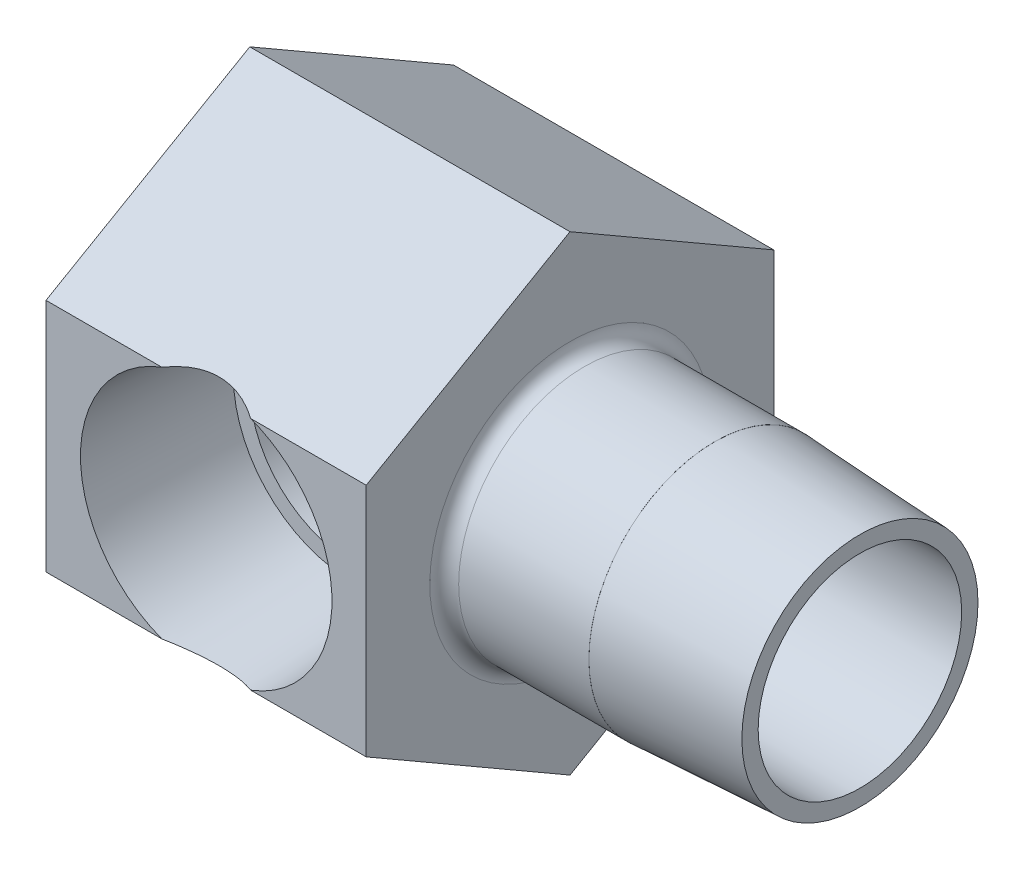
ISO-10303-21;
HEADER;
FILE_DESCRIPTION(('STEP AP214'),'2;1');
FILE_NAME('part.step','',(''),(''),'','','');
FILE_SCHEMA(('AUTOMOTIVE_DESIGN { 1 0 10303 214 1 1 1 1 }'));
ENDSEC;
DATA;
#1=APPLICATION_CONTEXT('core data for automotive mechanical design processes');
#2=APPLICATION_PROTOCOL_DEFINITION('international standard','automotive_design',2000,#1);
#3=PRODUCT_CONTEXT('',#1,'mechanical');
#4=PRODUCT('Part','Part','',(#3));
#5=PRODUCT_RELATED_PRODUCT_CATEGORY('part','',(#4));
#6=PRODUCT_DEFINITION_FORMATION('','',#4);
#7=PRODUCT_DEFINITION_CONTEXT('part definition',#1,'design');
#8=PRODUCT_DEFINITION('design','',#6,#7);
#9=PRODUCT_DEFINITION_SHAPE('','',#8);
#10=(LENGTH_UNIT() NAMED_UNIT(*) SI_UNIT(.MILLI.,.METRE.));
#11=(NAMED_UNIT(*) PLANE_ANGLE_UNIT() SI_UNIT($,.RADIAN.));
#12=(NAMED_UNIT(*) SI_UNIT($,.STERADIAN.) SOLID_ANGLE_UNIT());
#13=UNCERTAINTY_MEASURE_WITH_UNIT(LENGTH_MEASURE(1.E-05),#10,'distance_accuracy_value','');
#14=(GEOMETRIC_REPRESENTATION_CONTEXT(3) GLOBAL_UNCERTAINTY_ASSIGNED_CONTEXT((#13)) GLOBAL_UNIT_ASSIGNED_CONTEXT((#10,
#11,#12)) REPRESENTATION_CONTEXT('',''));
#15=CARTESIAN_POINT('',(0.,0.,0.));
#16=DIRECTION('',(0.,0.,1.));
#17=DIRECTION('',(1.,0.,0.));
#18=AXIS2_PLACEMENT_3D('',#15,#16,#17);
#19=CARTESIAN_POINT('',(7.9248,0.,0.));
#20=DIRECTION('',(-1.,0.,0.));
#21=DIRECTION('',(0.,0.,1.));
#22=AXIS2_PLACEMENT_3D('',#19,#20,#21);
#23=PLANE('',#22);
#24=CARTESIAN_POINT('',(7.9248,0.,0.));
#25=DIRECTION('',(-1.,0.,0.));
#26=DIRECTION('',(0.,0.,1.));
#27=AXIS2_PLACEMENT_3D('',#24,#25,#26);
#28=CIRCLE('',#27,5.5499);
#29=CARTESIAN_POINT('',(7.9248,0.,5.5499));
#30=VERTEX_POINT('',#29);
#31=EDGE_CURVE('E157',#30,#30,#28,.F.);
#32=ORIENTED_EDGE('',*,*,#31,.F.);
#33=EDGE_LOOP('',(#32));
#34=FACE_BOUND('',#33,.T.);
#35=CARTESIAN_POINT('',(7.9248,0.,0.));
#36=DIRECTION('',(-1.,0.,0.));
#37=DIRECTION('',(0.,0.,1.));
#38=AXIS2_PLACEMENT_3D('',#35,#36,#37);
#39=CIRCLE('',#38,6.4389);
#40=CARTESIAN_POINT('',(7.9248,0.,6.4389));
#41=VERTEX_POINT('',#40);
#42=EDGE_CURVE('E161',#41,#41,#39,.T.);
#43=ORIENTED_EDGE('',*,*,#42,.F.);
#44=EDGE_LOOP('',(#43));
#45=FACE_BOUND('',#44,.T.);
#46=ADVANCED_FACE('F14',(#34,#45),#23,.F.);
#47=CARTESIAN_POINT('',(38.1508,0.,0.));
#48=DIRECTION('',(-1.,0.,0.));
#49=DIRECTION('',(0.,0.,1.));
#50=AXIS2_PLACEMENT_3D('',#47,#48,#49);
#51=CYLINDRICAL_SURFACE('',#50,6.858);
#52=CARTESIAN_POINT('',(-7.0993,0.,0.));
#53=DIRECTION('',(-1.,0.,0.));
#54=DIRECTION('',(0.,-1.,0.));
#55=AXIS2_PLACEMENT_3D('',#52,#53,#54);
#56=CIRCLE('',#55,6.858);
#57=CARTESIAN_POINT('',(-7.0993,-6.858,0.));
#58=VERTEX_POINT('',#57);
#59=EDGE_CURVE('E22',#58,#58,#56,.F.);
#60=ORIENTED_EDGE('',*,*,#59,.T.);
#61=EDGE_LOOP('',(#60));
#62=FACE_BOUND('',#61,.T.);
#63=CARTESIAN_POINT('',(0.,0.,0.));
#64=DIRECTION('',(1.,0.,0.));
#65=DIRECTION('',(0.,0.,-1.));
#66=AXIS2_PLACEMENT_3D('',#63,#64,#65);
#67=CIRCLE('',#66,6.858);
#68=CARTESIAN_POINT('',(0.,0.,-6.858));
#69=VERTEX_POINT('',#68);
#70=EDGE_CURVE('E17',#69,#69,#67,.F.);
#71=ORIENTED_EDGE('',*,*,#70,.T.);
#72=EDGE_LOOP('',(#71));
#73=FACE_BOUND('',#72,.T.);
#74=ADVANCED_FACE('F169',(#62,#73),#51,.T.);
#75=CARTESIAN_POINT('',(-16.6116,0.,11.1125));
#76=DIRECTION('',(0.,0.,1.));
#77=DIRECTION('',(1.,0.,0.));
#78=AXIS2_PLACEMENT_3D('',#75,#76,#77);
#79=CONICAL_SURFACE('',#78,6.858,0.0523598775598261);
#80=CARTESIAN_POINT('',(-16.6116,-0.680996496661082,23.4045205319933));
#81=DIRECTION('',(0.,-0.866025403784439,-0.5));
#82=DIRECTION('',(0.,-0.5,0.866025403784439));
#83=AXIS2_PLACEMENT_3D('',#80,#81,#82);
#84=ELLIPSE('',#83,15.0043949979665,7.47122554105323);
#85=CARTESIAN_POINT('',(-14.1888718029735,6.4158048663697,11.1125));
#86=VERTEX_POINT('',#85);
#87=CARTESIAN_POINT('',(-19.0343281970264,6.4158048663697,11.1125));
#88=VERTEX_POINT('',#87);
#89=EDGE_CURVE('E226',#86,#88,#84,.F.);
#90=ORIENTED_EDGE('',*,*,#89,.T.);
#91=CARTESIAN_POINT('',(-16.6116,0.,11.1125));
#92=DIRECTION('',(0.,0.,-1.));
#93=DIRECTION('',(-1.,0.,0.));
#94=AXIS2_PLACEMENT_3D('',#91,#92,#93);
#95=CIRCLE('',#94,6.858);
#96=CARTESIAN_POINT('',(-19.0343281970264,-6.41580486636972,11.1125));
#97=VERTEX_POINT('',#96);
#98=EDGE_CURVE('E37',#97,#88,#95,.T.);
#99=ORIENTED_EDGE('',*,*,#98,.F.);
#100=CARTESIAN_POINT('',(-16.6116,0.680996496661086,23.4045205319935));
#101=DIRECTION('',(0.,0.866025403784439,-0.5));
#102=DIRECTION('',(0.,0.5,0.866025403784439));
#103=AXIS2_PLACEMENT_3D('',#100,#101,#102);
#104=ELLIPSE('',#103,15.0043949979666,7.47122554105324);
#105=CARTESIAN_POINT('',(-14.1888718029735,-6.4158048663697,11.1125));
#106=VERTEX_POINT('',#105);
#107=EDGE_CURVE('E9',#97,#106,#104,.F.);
#108=ORIENTED_EDGE('',*,*,#107,.T.);
#109=EDGE_CURVE('E243',#86,#106,#95,.T.);
#110=ORIENTED_EDGE('',*,*,#109,.F.);
#111=EDGE_LOOP('',(#90,#99,#108,#110));
#112=FACE_BOUND('',#111,.T.);
#113=CARTESIAN_POINT('',(-16.6116,0.,3.1877));
#114=DIRECTION('',(0.,0.,-1.));
#115=DIRECTION('',(-1.,0.,0.));
#116=AXIS2_PLACEMENT_3D('',#113,#114,#115);
#117=CIRCLE('',#116,6.44267883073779);
#118=CARTESIAN_POINT('',(-12.0434327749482,-4.54312213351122,3.1877));
#119=VERTEX_POINT('',#118);
#120=CARTESIAN_POINT('',(-12.0434327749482,4.54312213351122,3.1877));
#121=VERTEX_POINT('',#120);
#122=EDGE_CURVE('E245',#119,#121,#117,.T.);
#123=ORIENTED_EDGE('',*,*,#122,.T.);
#124=CARTESIAN_POINT('',(-12.0435871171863,4.54326245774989,3.1875));
#125=CARTESIAN_POINT('',(-11.9441962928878,4.45290836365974,3.31621906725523));
#126=CARTESIAN_POINT('',(-11.8453747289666,4.35690222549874,3.44148115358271));
#127=CARTESIAN_POINT('',(-11.6502698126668,4.15324987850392,3.68472903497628));
#128=CARTESIAN_POINT('',(-11.5539906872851,4.04558563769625,3.80270310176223));
#129=CARTESIAN_POINT('',(-11.3648299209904,3.81752411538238,4.03164857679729));
#130=CARTESIAN_POINT('',(-11.2719874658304,3.69701926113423,4.14254596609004));
#131=CARTESIAN_POINT('',(-11.0923535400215,3.44414434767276,4.35506206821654));
#132=CARTESIAN_POINT('',(-11.0055581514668,3.31178210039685,4.45668680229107));
#133=CARTESIAN_POINT('',(-10.7964313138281,2.96297657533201,4.69976178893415));
#134=CARTESIAN_POINT('',(-10.6790713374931,2.73858307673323,4.83446514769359));
#135=CARTESIAN_POINT('',(-10.5215825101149,2.38307262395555,5.01397800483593));
#136=CARTESIAN_POINT('',(-10.4722150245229,2.2615363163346,5.07001734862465));
#137=CARTESIAN_POINT('',(-10.3804227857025,2.0125151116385,5.17390985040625));
#138=CARTESIAN_POINT('',(-10.337994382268,1.88503338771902,5.22176731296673));
#139=CARTESIAN_POINT('',(-10.260466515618,1.6232487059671,5.30902180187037));
#140=CARTESIAN_POINT('',(-10.2254580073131,1.48888366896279,5.3483139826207));
#141=CARTESIAN_POINT('',(-10.1642214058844,1.21573970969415,5.41693438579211));
#142=CARTESIAN_POINT('',(-10.1379885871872,1.0769632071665,5.44626797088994));
#143=CARTESIAN_POINT('',(-10.0949533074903,0.796159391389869,5.49434315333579));
#144=CARTESIAN_POINT('',(-10.0781494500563,0.654132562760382,5.51308631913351));
#145=CARTESIAN_POINT('',(-10.0544334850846,0.368243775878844,5.5395290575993));
#146=CARTESIAN_POINT('',(-10.0475196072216,0.22438215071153,5.54723060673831));
#147=CARTESIAN_POINT('',(-10.0440618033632,-0.041379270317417,5.55108277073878));
#148=CARTESIAN_POINT('',(-10.0460821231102,-0.163241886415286,5.54883264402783));
#149=CARTESIAN_POINT('',(-10.0572859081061,-0.406265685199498,5.53634760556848));
#150=CARTESIAN_POINT('',(-10.066471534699,-0.527426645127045,5.52611028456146));
#151=CARTESIAN_POINT('',(-10.0918194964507,-0.768029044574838,5.49783431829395));
#152=CARTESIAN_POINT('',(-10.1079781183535,-0.887471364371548,5.4797998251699));
#153=CARTESIAN_POINT('',(-10.1469528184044,-1.1238947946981,5.43624186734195));
#154=CARTESIAN_POINT('',(-10.1697714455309,-1.24087494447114,5.41071553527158));
#155=CARTESIAN_POINT('',(-10.2461986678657,-1.58064044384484,5.32507161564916));
#156=CARTESIAN_POINT('',(-10.3085401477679,-1.79907617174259,5.25504548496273));
#157=CARTESIAN_POINT('',(-10.4532227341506,-2.2198653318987,5.09162883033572));
#158=CARTESIAN_POINT('',(-10.5355750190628,-2.42220969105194,4.99822524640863));
#159=CARTESIAN_POINT('',(-10.6910379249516,-2.75475802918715,4.82054677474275));
#160=CARTESIAN_POINT('',(-10.760322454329,-2.88934500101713,4.74098873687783));
#161=CARTESIAN_POINT('',(-10.9058041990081,-3.14876465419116,4.57280704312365));
#162=CARTESIAN_POINT('',(-10.9820017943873,-3.27359679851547,4.48418288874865));
#163=CARTESIAN_POINT('',(-11.1400903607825,-3.51355050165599,4.29876602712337));
#164=CARTESIAN_POINT('',(-11.2219905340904,-3.62865566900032,4.20196006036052));
#165=CARTESIAN_POINT('',(-11.3900878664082,-3.84892561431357,4.00116972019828));
#166=CARTESIAN_POINT('',(-11.476283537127,-3.95409379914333,3.89718782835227));
#167=CARTESIAN_POINT('',(-11.6422530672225,-4.14374167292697,3.69431209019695));
#168=CARTESIAN_POINT('',(-11.72170741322,-4.22922772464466,3.59609251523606));
#169=CARTESIAN_POINT('',(-11.8818501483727,-4.39212627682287,3.39517461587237));
#170=CARTESIAN_POINT('',(-11.962530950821,-4.4695749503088,3.29249959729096));
#171=CARTESIAN_POINT('',(-12.0435871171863,-4.54326245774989,3.1875));
#172=B_SPLINE_CURVE_WITH_KNOTS('',3,(#124,#125,#126,#127,#128,#129,#130,#131,#132,#133,#134,
#135,#136,#137,#138,#139,#140,#141,#142,#143,#144,#145,#146,#147,#148,#149,#150,#151,#152,#153,
#154,#155,#156,#157,#158,#159,#160,#161,#162,#163,#164,#165,#166,#167,#168,#169,#170,#171),
.UNSPECIFIED.,.F.,.F.,(4,2,2,2,2,2,2,2,2,2,2,2,2,2,2,2,2,2,2,2,2,2,2,4),(0.,0.558072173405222,
1.11702021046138,1.68108674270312,2.24478434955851,3.10140634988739,3.52893103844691,
3.95623010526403,4.38849766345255,4.82053207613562,5.2525024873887,5.68439556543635,
6.04963287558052,6.41498039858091,6.78013360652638,7.14542675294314,7.85550743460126,
8.5659856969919,9.07835413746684,9.59075076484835,10.1039943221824,10.6170612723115,
11.0743952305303,11.5295724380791),.UNSPECIFIED.);
#173=EDGE_CURVE('E130',#121,#119,#172,.T.);
#174=ORIENTED_EDGE('',*,*,#173,.T.);
#175=EDGE_LOOP('',(#123,#174));
#176=FACE_BOUND('',#175,.T.);
#177=ADVANCED_FACE('F138',(#112,#176),#79,.F.);
#178=CARTESIAN_POINT('',(-10.1689211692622,0.,3.1877));
#179=DIRECTION('',(0.,0.,1.));
#180=DIRECTION('',(1.,0.,0.));
#181=AXIS2_PLACEMENT_3D('',#178,#179,#180);
#182=PLANE('',#181);
#183=ORIENTED_EDGE('',*,*,#122,.F.);
#184=DIRECTION('',(1.,0.,0.));
#185=VECTOR('',#184,1.);
#186=CARTESIAN_POINT('',(40.2763637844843,-4.54312213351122,3.1877));
#187=LINE('',#186,#185);
#188=CARTESIAN_POINT('',(-13.4239,-4.54312213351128,3.1877));
#189=VERTEX_POINT('',#188);
#190=EDGE_CURVE('E128',#119,#189,#187,.F.);
#191=ORIENTED_EDGE('',*,*,#190,.T.);
#192=CARTESIAN_POINT('',(-16.6116,0.,3.1877));
#193=DIRECTION('',(0.,0.,-1.));
#194=DIRECTION('',(-1.,0.,0.));
#195=AXIS2_PLACEMENT_3D('',#192,#193,#194);
#196=CIRCLE('',#195,5.5499);
#197=CARTESIAN_POINT('',(-13.4239,4.54312213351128,3.1877));
#198=VERTEX_POINT('',#197);
#199=EDGE_CURVE('E120',#189,#198,#196,.T.);
#200=ORIENTED_EDGE('',*,*,#199,.T.);
#201=DIRECTION('',(1.,0.,0.));
#202=VECTOR('',#201,1.);
#203=CARTESIAN_POINT('',(40.2763637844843,4.54312213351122,3.1877));
#204=LINE('',#203,#202);
#205=EDGE_CURVE('E123',#198,#121,#204,.T.);
#206=ORIENTED_EDGE('',*,*,#205,.T.);
#207=EDGE_LOOP('',(#183,#191,#200,#206));
#208=FACE_BOUND('',#207,.T.);
#209=ADVANCED_FACE('F260',(#208),#182,.T.);
#210=CARTESIAN_POINT('',(-16.6116,0.,16.5155516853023));
#211=DIRECTION('',(0.,0.,-1.));
#212=DIRECTION('',(-1.,0.,0.));
#213=AXIS2_PLACEMENT_3D('',#210,#211,#212);
#214=CYLINDRICAL_SURFACE('',#213,5.5499);
#215=ORIENTED_EDGE('',*,*,#199,.F.);
#216=CARTESIAN_POINT('',(-16.6116,0.,0.));
#217=DIRECTION('',(0.707106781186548,0.,-0.707106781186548));
#218=DIRECTION('',(-0.707106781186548,0.,-0.707106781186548));
#219=AXIS2_PLACEMENT_3D('',#216,#217,#218);
#220=ELLIPSE('',#219,7.84874384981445,5.5499);
#221=CARTESIAN_POINT('',(-16.6116,-5.5499,0.));
#222=VERTEX_POINT('',#221);
#223=EDGE_CURVE('E109',#189,#222,#220,.T.);
#224=ORIENTED_EDGE('',*,*,#223,.T.);
#225=CARTESIAN_POINT('',(-16.6116,0.,0.));
#226=DIRECTION('',(-0.707106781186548,0.,-0.707106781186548));
#227=DIRECTION('',(0.707106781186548,0.,-0.707106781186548));
#228=AXIS2_PLACEMENT_3D('',#225,#226,#227);
#229=ELLIPSE('',#228,7.84874384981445,5.5499);
#230=CARTESIAN_POINT('',(-11.8783362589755,-2.89786203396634,-4.73326374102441));
#231=VERTEX_POINT('',#230);
#232=EDGE_CURVE('E105',#222,#231,#229,.F.);
#233=ORIENTED_EDGE('',*,*,#232,.T.);
#234=CARTESIAN_POINT('',(-16.6116,0.,-4.73326374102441));
#235=DIRECTION('',(0.,0.,-1.));
#236=DIRECTION('',(-1.,0.,0.));
#237=AXIS2_PLACEMENT_3D('',#234,#235,#236);
#238=CIRCLE('',#237,5.5499);
#239=CARTESIAN_POINT('',(-11.8783362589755,2.89786203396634,-4.73326374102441));
#240=VERTEX_POINT('',#239);
#241=EDGE_CURVE('E136',#231,#240,#238,.T.);
#242=ORIENTED_EDGE('',*,*,#241,.T.);
#243=CARTESIAN_POINT('',(-16.6116,5.5499,0.));
#244=VERTEX_POINT('',#243);
#245=EDGE_CURVE('E30',#240,#244,#229,.F.);
#246=ORIENTED_EDGE('',*,*,#245,.T.);
#247=EDGE_CURVE('E121',#244,#198,#220,.T.);
#248=ORIENTED_EDGE('',*,*,#247,.T.);
#249=EDGE_LOOP('',(#215,#224,#233,#242,#246,#248));
#250=FACE_BOUND('',#249,.T.);
#251=ADVANCED_FACE('F117',(#250),#214,.F.);
#252=CARTESIAN_POINT('',(-16.6116,0.,-4.73326374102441));
#253=DIRECTION('',(0.,0.,1.));
#254=DIRECTION('',(1.,0.,0.));
#255=AXIS2_PLACEMENT_3D('',#252,#253,#254);
#256=CONICAL_SURFACE('',#255,5.5499,1.04719755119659);
#257=CARTESIAN_POINT('',(-16.6116,0.,-7.9375));
#258=VERTEX_POINT('',#257);
#259=VERTEX_LOOP('',#258);
#260=FACE_BOUND('',#259,.T.);
#261=ORIENTED_EDGE('',*,*,#241,.F.);
#262=CARTESIAN_POINT('',(-11.8781300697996,-2.89818868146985,-4.73306374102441));
#263=CARTESIAN_POINT('',(-11.928514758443,-2.81852795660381,-4.78186576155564));
#264=CARTESIAN_POINT('',(-11.9754486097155,-2.73601453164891,-4.8296023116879));
#265=CARTESIAN_POINT('',(-12.0622060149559,-2.56583570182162,-4.92211262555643));
#266=CARTESIAN_POINT('',(-12.1020339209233,-2.47817349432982,-4.96688819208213));
#267=CARTESIAN_POINT('',(-12.1740452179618,-2.29911606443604,-5.05224677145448));
#268=CARTESIAN_POINT('',(-12.2063059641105,-2.20777091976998,-5.09286957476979));
#269=CARTESIAN_POINT('',(-12.2640536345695,-2.02119544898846,-5.16975209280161));
#270=CARTESIAN_POINT('',(-12.2895403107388,-1.92596498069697,-5.20601164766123));
#271=CARTESIAN_POINT('',(-12.3343485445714,-1.73255643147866,-5.27352942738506));
#272=CARTESIAN_POINT('',(-12.3536814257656,-1.63438413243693,-5.30479678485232));
#273=CARTESIAN_POINT('',(-12.3871169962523,-1.4356334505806,-5.36199992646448));
#274=CARTESIAN_POINT('',(-12.4012193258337,-1.33505490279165,-5.38793534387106));
#275=CARTESIAN_POINT('',(-12.4251473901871,-1.13183172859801,-5.43426547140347));
#276=CARTESIAN_POINT('',(-12.4349607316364,-1.02918199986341,-5.45464406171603));
#277=CARTESIAN_POINT('',(-12.4510925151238,-0.822623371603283,-5.48959537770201));
#278=CARTESIAN_POINT('',(-12.457410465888,-0.718714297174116,-5.50416728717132));
#279=CARTESIAN_POINT('',(-12.4681706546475,-0.489671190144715,-5.52968000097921));
#280=CARTESIAN_POINT('',(-12.4720032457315,-0.364365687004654,-5.53935082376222));
#281=CARTESIAN_POINT('',(-12.4762724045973,-0.113319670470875,-5.55016570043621));
#282=CARTESIAN_POINT('',(-12.4767084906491,0.0124209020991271,-5.55130854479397));
#283=CARTESIAN_POINT('',(-12.474260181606,0.263686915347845,-5.545056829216));
#284=CARTESIAN_POINT('',(-12.4713750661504,0.389212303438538,-5.53766041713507));
#285=CARTESIAN_POINT('',(-12.4617808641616,0.639322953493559,-5.51438352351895));
#286=CARTESIAN_POINT('',(-12.4550721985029,0.763908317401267,-5.49850397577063));
#287=CARTESIAN_POINT('',(-12.4375802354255,1.00072761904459,-5.46013354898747));
#288=CARTESIAN_POINT('',(-12.4271972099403,1.11310193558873,-5.4383291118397));
#289=CARTESIAN_POINT('',(-12.4012811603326,1.33574469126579,-5.38796805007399));
#290=CARTESIAN_POINT('',(-12.3857480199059,1.44601308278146,-5.35941127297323));
#291=CARTESIAN_POINT('',(-12.34837201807,1.66326683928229,-5.29600700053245));
#292=CARTESIAN_POINT('',(-12.326549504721,1.77026157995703,-5.26117992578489));
#293=CARTESIAN_POINT('',(-12.2754867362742,1.98033019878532,-5.1857632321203));
#294=CARTESIAN_POINT('',(-12.2462496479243,2.08340572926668,-5.14517607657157));
#295=CARTESIAN_POINT('',(-12.1706029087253,2.31167706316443,-5.04745101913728));
#296=CARTESIAN_POINT('',(-12.1216919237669,2.43541928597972,-4.98878928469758));
#297=CARTESIAN_POINT('',(-12.0380568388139,2.61414296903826,-4.89614210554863));
#298=CARTESIAN_POINT('',(-12.0083727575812,2.67271819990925,-4.86439175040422));
#299=CARTESIAN_POINT('',(-11.9457010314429,2.78735967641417,-4.79961930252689));
#300=CARTESIAN_POINT('',(-11.9127128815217,2.8434255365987,-4.76659701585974));
#301=CARTESIAN_POINT('',(-11.8781300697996,2.89818868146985,-4.73306374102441));
#302=B_SPLINE_CURVE_WITH_KNOTS('',3,(#262,#263,#264,#265,#266,#267,#268,#269,#270,#271,#272,
#273,#274,#275,#276,#277,#278,#279,#280,#281,#282,#283,#284,#285,#286,#287,#288,#289,#290,#291,
#292,#293,#294,#295,#296,#297,#298,#299,#300,#301),.UNSPECIFIED.,.F.,.F.,(4,2,2,2,2,2,2,2,2,2,2,
2,2,2,2,2,2,2,2,4),(0.,0.318348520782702,0.636501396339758,0.951244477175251,1.26599908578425,
1.58017112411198,1.89436476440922,2.20946038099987,2.52460027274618,2.90145665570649,
3.27836648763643,3.65535808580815,4.03230819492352,4.37682355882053,4.72134670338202,
5.06476748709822,5.40804184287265,5.84309066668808,6.06180090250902,6.28054461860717),.UNSPECIFIED.);
#303=EDGE_CURVE('E111',#231,#240,#302,.T.);
#304=ORIENTED_EDGE('',*,*,#303,.T.);
#305=EDGE_LOOP('',(#261,#304));
#306=FACE_BOUND('',#305,.T.);
#307=ADVANCED_FACE('F149',(#260,#306),#256,.F.);
#308=CARTESIAN_POINT('',(-7.8867,12.8316097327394,0.));
#309=DIRECTION('',(0.,-0.866025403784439,-0.5));
#310=DIRECTION('',(0.,0.5,-0.866025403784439));
#311=AXIS2_PLACEMENT_3D('',#308,#309,#310);
#312=PLANE('',#311);
#313=ORIENTED_EDGE('',*,*,#89,.F.);
#314=DIRECTION('',(-1.,0.,0.));
#315=VECTOR('',#314,1.);
#316=CARTESIAN_POINT('',(-7.8867,6.4158048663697,11.1125));
#317=LINE('',#316,#315);
#318=CARTESIAN_POINT('',(-7.8867,6.4158048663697,11.1125));
#319=VERTEX_POINT('',#318);
#320=EDGE_CURVE('E196',#319,#86,#317,.T.);
#321=ORIENTED_EDGE('',*,*,#320,.F.);
#322=DIRECTION('',(0.,-0.5,0.866025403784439));
#323=VECTOR('',#322,1.);
#324=CARTESIAN_POINT('',(-7.8867,12.8316097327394,0.));
#325=LINE('',#324,#323);
#326=CARTESIAN_POINT('',(-7.8867,12.8316097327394,0.));
#327=VERTEX_POINT('',#326);
#328=EDGE_CURVE('E216',#327,#319,#325,.T.);
#329=ORIENTED_EDGE('',*,*,#328,.F.);
#330=DIRECTION('',(-1.,0.,0.));
#331=VECTOR('',#330,1.);
#332=CARTESIAN_POINT('',(-7.8867,12.8316097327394,0.));
#333=LINE('',#332,#331);
#334=CARTESIAN_POINT('',(-25.3492,12.8316097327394,0.));
#335=VERTEX_POINT('',#334);
#336=EDGE_CURVE('E193',#327,#335,#333,.T.);
#337=ORIENTED_EDGE('',*,*,#336,.T.);
#338=DIRECTION('',(0.,-0.5,0.866025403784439));
#339=VECTOR('',#338,1.);
#340=CARTESIAN_POINT('',(-25.3492,12.8316097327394,0.));
#341=LINE('',#340,#339);
#342=CARTESIAN_POINT('',(-25.3492,6.4158048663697,11.1125));
#343=VERTEX_POINT('',#342);
#344=EDGE_CURVE('E233',#335,#343,#341,.T.);
#345=ORIENTED_EDGE('',*,*,#344,.T.);
#346=EDGE_CURVE('E199',#88,#343,#317,.T.);
#347=ORIENTED_EDGE('',*,*,#346,.F.);
#348=EDGE_LOOP('',(#313,#321,#329,#337,#345,#347));
#349=FACE_BOUND('',#348,.T.);
#350=ADVANCED_FACE('F250',(#349),#312,.F.);
#351=CARTESIAN_POINT('',(-7.8867,6.4158048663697,11.1125));
#352=DIRECTION('',(0.,0.,-1.));
#353=DIRECTION('',(0.,1.,0.));
#354=AXIS2_PLACEMENT_3D('',#351,#352,#353);
#355=PLANE('',#354);
#356=ORIENTED_EDGE('',*,*,#98,.T.);
#357=ORIENTED_EDGE('',*,*,#346,.T.);
#358=DIRECTION('',(0.,-1.,0.));
#359=VECTOR('',#358,1.);
#360=CARTESIAN_POINT('',(-25.3492,6.4158048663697,11.1125));
#361=LINE('',#360,#359);
#362=CARTESIAN_POINT('',(-25.3492,-6.41580486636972,11.1125));
#363=VERTEX_POINT('',#362);
#364=EDGE_CURVE('E229',#343,#363,#361,.T.);
#365=ORIENTED_EDGE('',*,*,#364,.T.);
#366=DIRECTION('',(-1.,0.,0.));
#367=VECTOR('',#366,1.);
#368=CARTESIAN_POINT('',(-7.8867,-6.41580486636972,11.1125));
#369=LINE('',#368,#367);
#370=EDGE_CURVE('E203',#97,#363,#369,.T.);
#371=ORIENTED_EDGE('',*,*,#370,.F.);
#372=EDGE_LOOP('',(#356,#357,#365,#371));
#373=FACE_BOUND('',#372,.T.);
#374=ADVANCED_FACE('F257',(#373),#355,.F.);
#375=ORIENTED_EDGE('',*,*,#109,.T.);
#376=CARTESIAN_POINT('',(-7.8867,-6.41580486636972,11.1125));
#377=VERTEX_POINT('',#376);
#378=EDGE_CURVE('E200',#377,#106,#369,.T.);
#379=ORIENTED_EDGE('',*,*,#378,.F.);
#380=DIRECTION('',(0.,-1.,0.));
#381=VECTOR('',#380,1.);
#382=CARTESIAN_POINT('',(-7.8867,6.4158048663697,11.1125));
#383=LINE('',#382,#381);
#384=EDGE_CURVE('E214',#319,#377,#383,.T.);
#385=ORIENTED_EDGE('',*,*,#384,.F.);
#386=ORIENTED_EDGE('',*,*,#320,.T.);
#387=EDGE_LOOP('',(#375,#379,#385,#386));
#388=FACE_BOUND('',#387,.T.);
#389=ADVANCED_FACE('F283',(#388),#355,.F.);
#390=CARTESIAN_POINT('',(-7.8867,-6.41580486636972,11.1125));
#391=DIRECTION('',(0.,0.866025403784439,-0.5));
#392=DIRECTION('',(0.,0.5,0.866025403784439));
#393=AXIS2_PLACEMENT_3D('',#390,#391,#392);
#394=PLANE('',#393);
#395=ORIENTED_EDGE('',*,*,#107,.F.);
#396=ORIENTED_EDGE('',*,*,#370,.T.);
#397=DIRECTION('',(0.,-0.5,-0.866025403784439));
#398=VECTOR('',#397,1.);
#399=CARTESIAN_POINT('',(-25.3492,-6.41580486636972,11.1125));
#400=LINE('',#399,#398);
#401=CARTESIAN_POINT('',(-25.3492,-12.8316097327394,0.));
#402=VERTEX_POINT('',#401);
#403=EDGE_CURVE('E212',#363,#402,#400,.T.);
#404=ORIENTED_EDGE('',*,*,#403,.T.);
#405=DIRECTION('',(-1.,0.,0.));
#406=VECTOR('',#405,1.);
#407=CARTESIAN_POINT('',(-7.8867,-12.8316097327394,0.));
#408=LINE('',#407,#406);
#409=CARTESIAN_POINT('',(-7.8867,-12.8316097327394,0.));
#410=VERTEX_POINT('',#409);
#411=EDGE_CURVE('E204',#410,#402,#408,.T.);
#412=ORIENTED_EDGE('',*,*,#411,.F.);
#413=DIRECTION('',(0.,-0.5,-0.866025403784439));
#414=VECTOR('',#413,1.);
#415=CARTESIAN_POINT('',(-7.8867,-6.41580486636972,11.1125));
#416=LINE('',#415,#414);
#417=EDGE_CURVE('E207',#377,#410,#416,.T.);
#418=ORIENTED_EDGE('',*,*,#417,.F.);
#419=ORIENTED_EDGE('',*,*,#378,.T.);
#420=EDGE_LOOP('',(#395,#396,#404,#412,#418,#419));
#421=FACE_BOUND('',#420,.T.);
#422=ADVANCED_FACE('F279',(#421),#394,.F.);
#423=CARTESIAN_POINT('',(-7.8867,-12.8316097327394,0.));
#424=DIRECTION('',(0.,0.866025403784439,0.5));
#425=DIRECTION('',(0.,-0.5,0.866025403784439));
#426=AXIS2_PLACEMENT_3D('',#423,#424,#425);
#427=PLANE('',#426);
#428=DIRECTION('',(0.,0.5,-0.866025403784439));
#429=VECTOR('',#428,1.);
#430=CARTESIAN_POINT('',(-25.3492,-12.8316097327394,0.));
#431=LINE('',#430,#429);
#432=CARTESIAN_POINT('',(-25.3492,-6.41580486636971,-11.1125));
#433=VERTEX_POINT('',#432);
#434=EDGE_CURVE('E221',#402,#433,#431,.T.);
#435=ORIENTED_EDGE('',*,*,#434,.T.);
#436=DIRECTION('',(-1.,0.,0.));
#437=VECTOR('',#436,1.);
#438=CARTESIAN_POINT('',(-7.8867,-6.41580486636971,-11.1125));
#439=LINE('',#438,#437);
#440=CARTESIAN_POINT('',(-7.8867,-6.41580486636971,-11.1125));
#441=VERTEX_POINT('',#440);
#442=EDGE_CURVE('E187',#441,#433,#439,.T.);
#443=ORIENTED_EDGE('',*,*,#442,.F.);
#444=DIRECTION('',(0.,0.5,-0.866025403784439));
#445=VECTOR('',#444,1.);
#446=CARTESIAN_POINT('',(-7.8867,-12.8316097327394,0.));
#447=LINE('',#446,#445);
#448=EDGE_CURVE('E208',#410,#441,#447,.T.);
#449=ORIENTED_EDGE('',*,*,#448,.F.);
#450=ORIENTED_EDGE('',*,*,#411,.T.);
#451=EDGE_LOOP('',(#435,#443,#449,#450));
#452=FACE_BOUND('',#451,.T.);
#453=ADVANCED_FACE('F282',(#452),#427,.F.);
#454=CARTESIAN_POINT('',(-7.8867,-6.41580486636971,-11.1125));
#455=DIRECTION('',(0.,0.,1.));
#456=DIRECTION('',(1.,0.,0.));
#457=AXIS2_PLACEMENT_3D('',#454,#455,#456);
#458=PLANE('',#457);
#459=DIRECTION('',(0.,1.,0.));
#460=VECTOR('',#459,1.);
#461=CARTESIAN_POINT('',(-25.3492,-6.41580486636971,-11.1125));
#462=LINE('',#461,#460);
#463=CARTESIAN_POINT('',(-25.3492,6.41580486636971,-11.1125));
#464=VERTEX_POINT('',#463);
#465=EDGE_CURVE('E225',#433,#464,#462,.T.);
#466=ORIENTED_EDGE('',*,*,#465,.T.);
#467=DIRECTION('',(-1.,0.,0.));
#468=VECTOR('',#467,1.);
#469=CARTESIAN_POINT('',(-7.8867,6.41580486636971,-11.1125));
#470=LINE('',#469,#468);
#471=CARTESIAN_POINT('',(-7.8867,6.41580486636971,-11.1125));
#472=VERTEX_POINT('',#471);
#473=EDGE_CURVE('E190',#472,#464,#470,.T.);
#474=ORIENTED_EDGE('',*,*,#473,.F.);
#475=DIRECTION('',(0.,1.,0.));
#476=VECTOR('',#475,1.);
#477=CARTESIAN_POINT('',(-7.8867,-6.41580486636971,-11.1125));
#478=LINE('',#477,#476);
#479=EDGE_CURVE('E211',#441,#472,#478,.T.);
#480=ORIENTED_EDGE('',*,*,#479,.F.);
#481=ORIENTED_EDGE('',*,*,#442,.T.);
#482=EDGE_LOOP('',(#466,#474,#480,#481));
#483=FACE_BOUND('',#482,.T.);
#484=ADVANCED_FACE('F290',(#483),#458,.F.);
#485=CARTESIAN_POINT('',(-7.8867,6.4158048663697,-11.1125));
#486=DIRECTION('',(0.,-0.866025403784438,0.5));
#487=DIRECTION('',(0.,-0.5,-0.866025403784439));
#488=AXIS2_PLACEMENT_3D('',#485,#486,#487);
#489=PLANE('',#488);
#490=DIRECTION('',(0.,0.5,0.866025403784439));
#491=VECTOR('',#490,1.);
#492=CARTESIAN_POINT('',(-25.3492,6.4158048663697,-11.1125));
#493=LINE('',#492,#491);
#494=EDGE_CURVE('E237',#464,#335,#493,.T.);
#495=ORIENTED_EDGE('',*,*,#494,.T.);
#496=ORIENTED_EDGE('',*,*,#336,.F.);
#497=DIRECTION('',(0.,0.5,0.866025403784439));
#498=VECTOR('',#497,1.);
#499=CARTESIAN_POINT('',(-7.8867,6.4158048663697,-11.1125));
#500=LINE('',#499,#498);
#501=EDGE_CURVE('E218',#472,#327,#500,.T.);
#502=ORIENTED_EDGE('',*,*,#501,.F.);
#503=ORIENTED_EDGE('',*,*,#473,.T.);
#504=EDGE_LOOP('',(#495,#496,#502,#503));
#505=FACE_BOUND('',#504,.T.);
#506=ADVANCED_FACE('F277',(#505),#489,.F.);
#507=CARTESIAN_POINT('',(-7.8867,-19.2474145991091,11.1125));
#508=DIRECTION('',(-1.,0.,0.));
#509=DIRECTION('',(0.,-1.,0.));
#510=AXIS2_PLACEMENT_3D('',#507,#508,#509);
#511=PLANE('',#510);
#512=CARTESIAN_POINT('',(-7.8867,0.,0.));
#513=DIRECTION('',(-1.,0.,0.));
#514=DIRECTION('',(0.,-1.,0.));
#515=AXIS2_PLACEMENT_3D('',#512,#513,#514);
#516=CIRCLE('',#515,7.6454);
#517=CARTESIAN_POINT('',(-7.8867,-7.6454,0.));
#518=VERTEX_POINT('',#517);
#519=EDGE_CURVE('E184',#518,#518,#516,.T.);
#520=ORIENTED_EDGE('',*,*,#519,.T.);
#521=EDGE_LOOP('',(#520));
#522=FACE_BOUND('',#521,.T.);
#523=ORIENTED_EDGE('',*,*,#448,.T.);
#524=ORIENTED_EDGE('',*,*,#479,.T.);
#525=ORIENTED_EDGE('',*,*,#501,.T.);
#526=ORIENTED_EDGE('',*,*,#328,.T.);
#527=ORIENTED_EDGE('',*,*,#384,.T.);
#528=ORIENTED_EDGE('',*,*,#417,.T.);
#529=EDGE_LOOP('',(#523,#524,#525,#526,#527,#528));
#530=FACE_BOUND('',#529,.T.);
#531=ADVANCED_FACE('F273',(#522,#530),#511,.F.);
#532=CARTESIAN_POINT('',(-25.3492,-19.2474145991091,11.1125));
#533=DIRECTION('',(-1.,0.,0.));
#534=DIRECTION('',(0.,-1.,0.));
#535=AXIS2_PLACEMENT_3D('',#532,#533,#534);
#536=PLANE('',#535);
#537=ORIENTED_EDGE('',*,*,#434,.F.);
#538=ORIENTED_EDGE('',*,*,#403,.F.);
#539=ORIENTED_EDGE('',*,*,#364,.F.);
#540=ORIENTED_EDGE('',*,*,#344,.F.);
#541=ORIENTED_EDGE('',*,*,#494,.F.);
#542=ORIENTED_EDGE('',*,*,#465,.F.);
#543=EDGE_LOOP('',(#537,#538,#539,#540,#541,#542));
#544=FACE_BOUND('',#543,.T.);
#545=ADVANCED_FACE('F268',(#544),#536,.T.);
#546=CARTESIAN_POINT('',(-7.0993,0.,0.));
#547=DIRECTION('',(-1.,0.,0.));
#548=DIRECTION('',(0.,-1.,0.));
#549=AXIS2_PLACEMENT_3D('',#546,#547,#548);
#550=TOROIDAL_SURFACE('',#549,7.6454,0.7874);
#551=ORIENTED_EDGE('',*,*,#59,.F.);
#552=EDGE_LOOP('',(#551));
#553=FACE_BOUND('',#552,.T.);
#554=ORIENTED_EDGE('',*,*,#519,.F.);
#555=EDGE_LOOP('',(#554));
#556=FACE_BOUND('',#555,.T.);
#557=ADVANCED_FACE('F146',(#553,#556),#550,.F.);
#558=CARTESIAN_POINT('',(40.2763637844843,0.,0.));
#559=DIRECTION('',(1.,0.,0.));
#560=DIRECTION('',(0.,0.,-1.));
#561=AXIS2_PLACEMENT_3D('',#558,#559,#560);
#562=CYLINDRICAL_SURFACE('',#561,5.5499);
#563=ORIENTED_EDGE('',*,*,#31,.T.);
#564=EDGE_LOOP('',(#563));
#565=FACE_BOUND('',#564,.T.);
#566=ORIENTED_EDGE('',*,*,#205,.F.);
#567=ORIENTED_EDGE('',*,*,#247,.F.);
#568=ORIENTED_EDGE('',*,*,#245,.F.);
#569=ORIENTED_EDGE('',*,*,#303,.F.);
#570=ORIENTED_EDGE('',*,*,#232,.F.);
#571=ORIENTED_EDGE('',*,*,#223,.F.);
#572=ORIENTED_EDGE('',*,*,#190,.F.);
#573=ORIENTED_EDGE('',*,*,#173,.F.);
#574=EDGE_LOOP('',(#566,#567,#568,#569,#570,#571,#572,#573));
#575=FACE_BOUND('',#574,.T.);
#576=ADVANCED_FACE('F107',(#565,#575),#562,.F.);
#577=CARTESIAN_POINT('',(0.,0.,-6.85422116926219));
#578=DIRECTION('',(1.,0.,0.));
#579=DIRECTION('',(0.,0.,-1.));
#580=AXIS2_PLACEMENT_3D('',#577,#578,#579);
#581=PLANE('',#580);
#582=ORIENTED_EDGE('',*,*,#70,.F.);
#583=EDGE_LOOP('',(#582));
#584=FACE_BOUND('',#583,.T.);
#585=CARTESIAN_POINT('',(0.,0.,0.));
#586=DIRECTION('',(-1.,0.,0.));
#587=DIRECTION('',(0.,0.,1.));
#588=AXIS2_PLACEMENT_3D('',#585,#586,#587);
#589=CIRCLE('',#588,6.85422116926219);
#590=CARTESIAN_POINT('',(0.,0.,6.85422116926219));
#591=VERTEX_POINT('',#590);
#592=EDGE_CURVE('E158',#591,#591,#589,.T.);
#593=ORIENTED_EDGE('',*,*,#592,.T.);
#594=EDGE_LOOP('',(#593));
#595=FACE_BOUND('',#594,.T.);
#596=ADVANCED_FACE('F145',(#584,#595),#581,.T.);
#597=CARTESIAN_POINT('',(0.,0.,0.));
#598=DIRECTION('',(-1.,0.,0.));
#599=DIRECTION('',(0.,0.,1.));
#600=AXIS2_PLACEMENT_3D('',#597,#598,#599);
#601=CONICAL_SURFACE('',#600,6.85422116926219,0.0523598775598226);
#602=ORIENTED_EDGE('',*,*,#42,.T.);
#603=EDGE_LOOP('',(#602));
#604=FACE_BOUND('',#603,.T.);
#605=ORIENTED_EDGE('',*,*,#592,.F.);
#606=EDGE_LOOP('',(#605));
#607=FACE_BOUND('',#606,.T.);
#608=ADVANCED_FACE('F165',(#604,#607),#601,.T.);
#609=CLOSED_SHELL('',(#46,#74,#177,#209,#251,#307,#350,#374,#389,#422,#453,#484,#506,#531,#545,
#557,#576,#596,#608));
#610=MANIFOLD_SOLID_BREP('B1',#609);
#611=ADVANCED_BREP_SHAPE_REPRESENTATION('',(#18,#610),#14);
#612=SHAPE_DEFINITION_REPRESENTATION(#9,#611);
ENDSEC;
END-ISO-10303-21;
